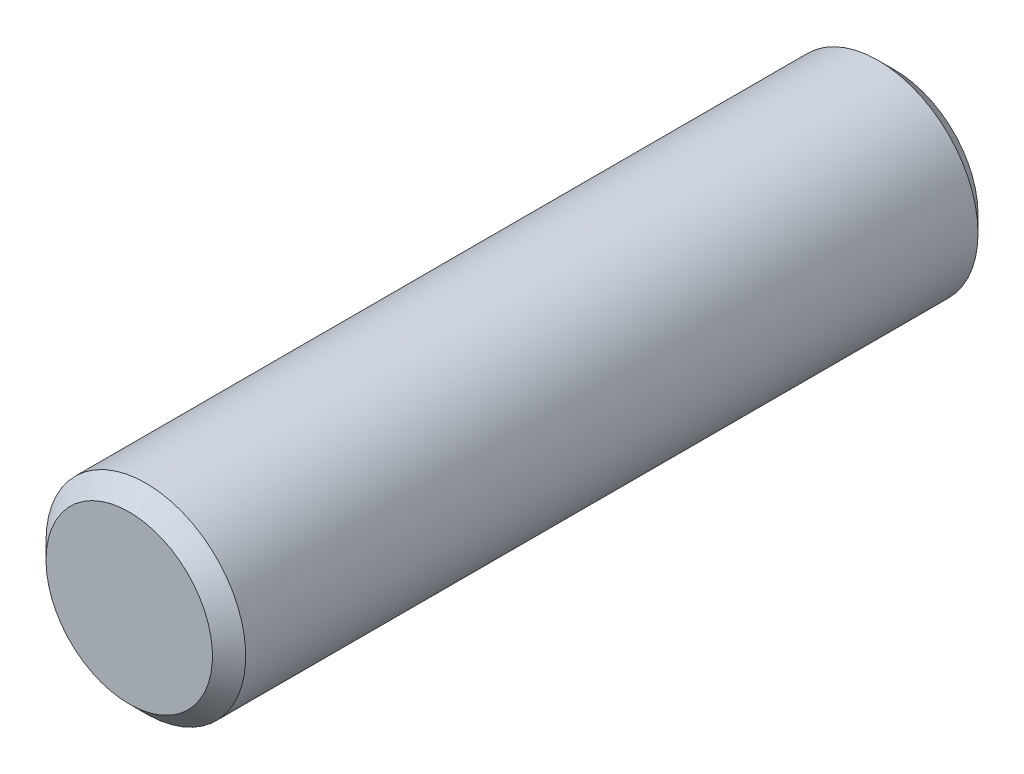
from build123d import *

# Parameters (mm, degrees)
ESQUISSE1_R          = 6
BASE_EXTRUSION_DEPTH = 46
CHANFREIN1_SIZE      = 1


with BuildPart() as part:
    # Esquisse1 → Base-Extrusion (new body)
    with BuildSketch(Plane.XY):
        with Locations(Location((0, 0, 0), (0, 0, 180))):
            Circle(ESQUISSE1_R)
    extrude(amount=BASE_EXTRUSION_DEPTH)

    # Chanfrein1
    chanfrein1_edges = [part.edges().sort_by_distance(p)[0] for p in [
        (6, 0, 0),
        (6, 0, 46),
    ]]
    chamfer(chanfrein1_edges, length=CHANFREIN1_SIZE)


solid = part.part
